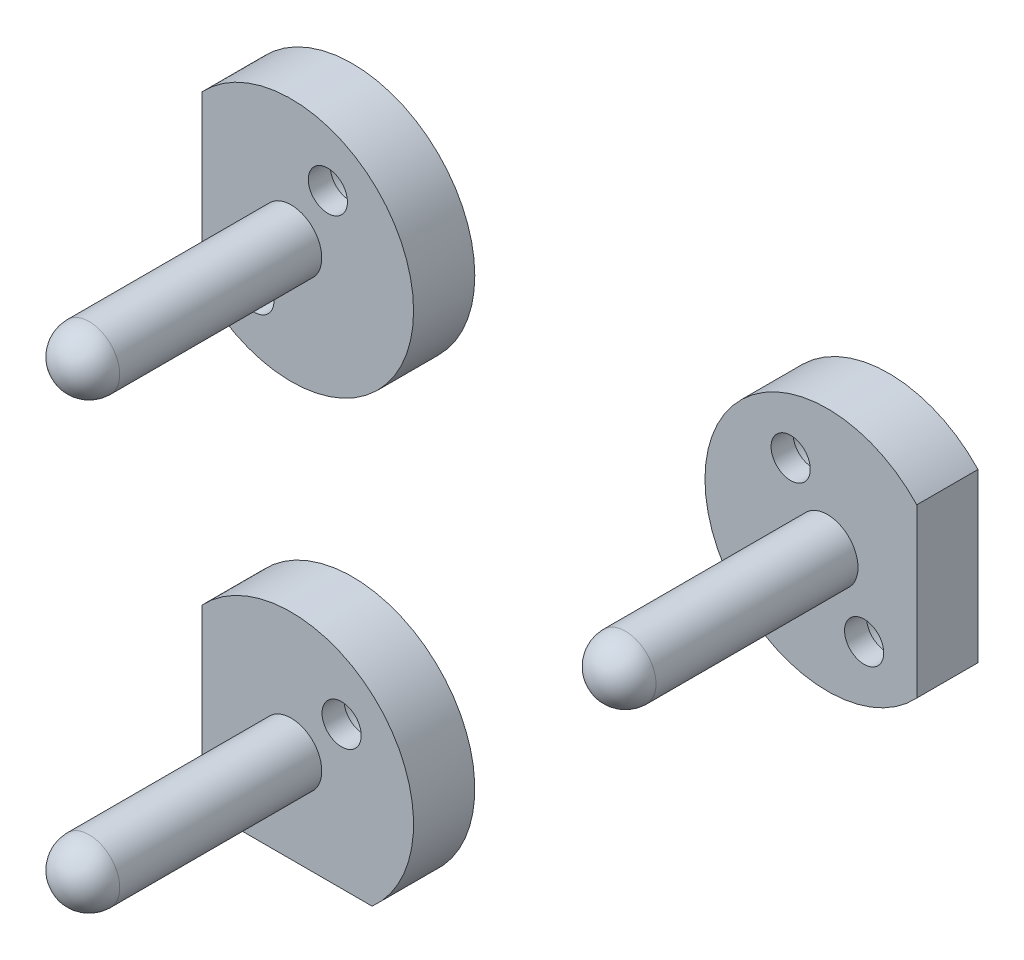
ISO-10303-21;
HEADER;
FILE_DESCRIPTION(('STEP AP214'),'2;1');
FILE_NAME('part.step','',(''),(''),'','','');
FILE_SCHEMA(('AUTOMOTIVE_DESIGN { 1 0 10303 214 1 1 1 1 }'));
ENDSEC;
DATA;
#1=APPLICATION_CONTEXT('core data for automotive mechanical design processes');
#2=APPLICATION_PROTOCOL_DEFINITION('international standard','automotive_design',2000,#1);
#3=PRODUCT_CONTEXT('',#1,'mechanical');
#4=PRODUCT('Part','Part','',(#3));
#5=PRODUCT_RELATED_PRODUCT_CATEGORY('part','',(#4));
#6=PRODUCT_DEFINITION_FORMATION('','',#4);
#7=PRODUCT_DEFINITION_CONTEXT('part definition',#1,'design');
#8=PRODUCT_DEFINITION('design','',#6,#7);
#9=PRODUCT_DEFINITION_SHAPE('','',#8);
#10=(LENGTH_UNIT() NAMED_UNIT(*) SI_UNIT(.MILLI.,.METRE.));
#11=(NAMED_UNIT(*) PLANE_ANGLE_UNIT() SI_UNIT($,.RADIAN.));
#12=(NAMED_UNIT(*) SI_UNIT($,.STERADIAN.) SOLID_ANGLE_UNIT());
#13=UNCERTAINTY_MEASURE_WITH_UNIT(LENGTH_MEASURE(1.E-05),#10,'distance_accuracy_value','');
#14=(GEOMETRIC_REPRESENTATION_CONTEXT(3) GLOBAL_UNCERTAINTY_ASSIGNED_CONTEXT((#13)) GLOBAL_UNIT_ASSIGNED_CONTEXT((#10,
#11,#12)) REPRESENTATION_CONTEXT('',''));
#15=CARTESIAN_POINT('',(0.,0.,0.));
#16=DIRECTION('',(0.,0.,1.));
#17=DIRECTION('',(1.,0.,0.));
#18=AXIS2_PLACEMENT_3D('',#15,#16,#17);
#19=CARTESIAN_POINT('',(21.9,16.9,5.));
#20=DIRECTION('',(0.,0.,-1.));
#21=DIRECTION('',(-1.,0.,0.));
#22=AXIS2_PLACEMENT_3D('',#19,#20,#21);
#23=CYLINDRICAL_SURFACE('',#22,10.);
#24=DIRECTION('',(0.,0.,-1.));
#25=VECTOR('',#24,1.);
#26=CARTESIAN_POINT('',(29.2,10.0655285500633,10.));
#27=LINE('',#26,#25);
#28=CARTESIAN_POINT('',(29.2,10.0655285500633,5.));
#29=VERTEX_POINT('',#28);
#30=CARTESIAN_POINT('',(29.2,10.0655285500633,0.));
#31=VERTEX_POINT('',#30);
#32=EDGE_CURVE('E63',#29,#31,#27,.T.);
#33=ORIENTED_EDGE('',*,*,#32,.F.);
#34=CARTESIAN_POINT('',(21.9,16.9,5.));
#35=DIRECTION('',(0.,0.,1.));
#36=DIRECTION('',(-1.,0.,0.));
#37=AXIS2_PLACEMENT_3D('',#34,#35,#36);
#38=CIRCLE('',#37,10.);
#39=CARTESIAN_POINT('',(29.2,23.7344714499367,5.));
#40=VERTEX_POINT('',#39);
#41=EDGE_CURVE('E84',#40,#29,#38,.T.);
#42=ORIENTED_EDGE('',*,*,#41,.F.);
#43=DIRECTION('',(0.,0.,-1.));
#44=VECTOR('',#43,1.);
#45=CARTESIAN_POINT('',(29.2,23.7344714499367,10.));
#46=LINE('',#45,#44);
#47=CARTESIAN_POINT('',(29.2,23.7344714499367,0.));
#48=VERTEX_POINT('',#47);
#49=EDGE_CURVE('E68',#40,#48,#46,.T.);
#50=ORIENTED_EDGE('',*,*,#49,.T.);
#51=CARTESIAN_POINT('',(21.9,16.9,0.));
#52=DIRECTION('',(0.,0.,1.));
#53=DIRECTION('',(-1.,0.,0.));
#54=AXIS2_PLACEMENT_3D('',#51,#52,#53);
#55=CIRCLE('',#54,10.);
#56=EDGE_CURVE('E82',#48,#31,#55,.T.);
#57=ORIENTED_EDGE('',*,*,#56,.T.);
#58=EDGE_LOOP('',(#33,#42,#50,#57));
#59=FACE_BOUND('',#58,.T.);
#60=ADVANCED_FACE('F48',(#59),#23,.T.);
#61=CARTESIAN_POINT('',(21.9,16.9,5.));
#62=DIRECTION('',(0.,0.,-1.));
#63=DIRECTION('',(-1.,0.,0.));
#64=AXIS2_PLACEMENT_3D('',#61,#62,#63);
#65=PLANE('',#64);
#66=CARTESIAN_POINT('',(18.9,21.9,5.));
#67=DIRECTION('',(0.,0.,-1.));
#68=DIRECTION('',(-1.,0.,0.));
#69=AXIS2_PLACEMENT_3D('',#66,#67,#68);
#70=CIRCLE('',#69,1.6);
#71=CARTESIAN_POINT('',(17.3,21.9,5.));
#72=VERTEX_POINT('',#71);
#73=EDGE_CURVE('E98',#72,#72,#70,.F.);
#74=ORIENTED_EDGE('',*,*,#73,.F.);
#75=EDGE_LOOP('',(#74));
#76=FACE_BOUND('',#75,.T.);
#77=CARTESIAN_POINT('',(24.9,11.9,5.));
#78=DIRECTION('',(0.,0.,-1.));
#79=DIRECTION('',(-1.,0.,0.));
#80=AXIS2_PLACEMENT_3D('',#77,#78,#79);
#81=CIRCLE('',#80,1.6);
#82=CARTESIAN_POINT('',(23.3,11.9,5.));
#83=VERTEX_POINT('',#82);
#84=EDGE_CURVE('E110',#83,#83,#81,.F.);
#85=ORIENTED_EDGE('',*,*,#84,.F.);
#86=EDGE_LOOP('',(#85));
#87=FACE_BOUND('',#86,.T.);
#88=CARTESIAN_POINT('',(21.9,16.9,5.));
#89=DIRECTION('',(0.,0.,1.));
#90=DIRECTION('',(1.,0.,0.));
#91=AXIS2_PLACEMENT_3D('',#88,#89,#90);
#92=CIRCLE('',#91,2.5);
#93=CARTESIAN_POINT('',(24.4,16.9,5.));
#94=VERTEX_POINT('',#93);
#95=EDGE_CURVE('E56',#94,#94,#92,.T.);
#96=ORIENTED_EDGE('',*,*,#95,.F.);
#97=EDGE_LOOP('',(#96));
#98=FACE_BOUND('',#97,.T.);
#99=DIRECTION('',(0.,-1.,0.));
#100=VECTOR('',#99,1.);
#101=CARTESIAN_POINT('',(29.2,16.9,5.));
#102=LINE('',#101,#100);
#103=EDGE_CURVE('E78',#40,#29,#102,.T.);
#104=ORIENTED_EDGE('',*,*,#103,.F.);
#105=ORIENTED_EDGE('',*,*,#41,.T.);
#106=EDGE_LOOP('',(#104,#105));
#107=FACE_BOUND('',#106,.T.);
#108=ADVANCED_FACE('F138',(#76,#87,#98,#107),#65,.F.);
#109=CARTESIAN_POINT('',(21.9,16.9,0.));
#110=DIRECTION('',(0.,0.,-1.));
#111=DIRECTION('',(-1.,0.,0.));
#112=AXIS2_PLACEMENT_3D('',#109,#110,#111);
#113=PLANE('',#112);
#114=CARTESIAN_POINT('',(18.9,21.9,0.));
#115=DIRECTION('',(0.,0.,-1.));
#116=DIRECTION('',(-1.,0.,0.));
#117=AXIS2_PLACEMENT_3D('',#114,#115,#116);
#118=CIRCLE('',#117,2.85);
#119=CARTESIAN_POINT('',(16.05,21.9,0.));
#120=VERTEX_POINT('',#119);
#121=EDGE_CURVE('E101',#120,#120,#118,.T.);
#122=ORIENTED_EDGE('',*,*,#121,.F.);
#123=EDGE_LOOP('',(#122));
#124=FACE_BOUND('',#123,.T.);
#125=CARTESIAN_POINT('',(24.9,11.9,0.));
#126=DIRECTION('',(0.,0.,-1.));
#127=DIRECTION('',(-1.,0.,0.));
#128=AXIS2_PLACEMENT_3D('',#125,#126,#127);
#129=CIRCLE('',#128,2.85);
#130=CARTESIAN_POINT('',(22.05,11.9,0.));
#131=VERTEX_POINT('',#130);
#132=EDGE_CURVE('E97',#131,#131,#129,.T.);
#133=ORIENTED_EDGE('',*,*,#132,.F.);
#134=EDGE_LOOP('',(#133));
#135=FACE_BOUND('',#134,.T.);
#136=ORIENTED_EDGE('',*,*,#56,.F.);
#137=DIRECTION('',(0.,-1.,0.));
#138=VECTOR('',#137,1.);
#139=CARTESIAN_POINT('',(29.2,23.7344714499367,0.));
#140=LINE('',#139,#138);
#141=EDGE_CURVE('E73',#48,#31,#140,.T.);
#142=ORIENTED_EDGE('',*,*,#141,.T.);
#143=EDGE_LOOP('',(#136,#142));
#144=FACE_BOUND('',#143,.T.);
#145=ADVANCED_FACE('F87',(#124,#135,#144),#113,.T.);
#146=CARTESIAN_POINT('',(21.9,16.9,24.));
#147=DIRECTION('',(0.,0.,-1.));
#148=DIRECTION('',(-1.,0.,0.));
#149=AXIS2_PLACEMENT_3D('',#146,#147,#148);
#150=CYLINDRICAL_SURFACE('',#149,2.5);
#151=CARTESIAN_POINT('',(21.9,16.9,21.5));
#152=DIRECTION('',(0.,0.,-1.));
#153=DIRECTION('',(-1.,0.,0.));
#154=AXIS2_PLACEMENT_3D('',#151,#152,#153);
#155=CIRCLE('',#154,2.5);
#156=CARTESIAN_POINT('',(19.4,16.9,21.5));
#157=VERTEX_POINT('',#156);
#158=EDGE_CURVE('E12',#157,#157,#155,.T.);
#159=ORIENTED_EDGE('',*,*,#158,.T.);
#160=EDGE_LOOP('',(#159));
#161=FACE_BOUND('',#160,.T.);
#162=ORIENTED_EDGE('',*,*,#95,.T.);
#163=EDGE_LOOP('',(#162));
#164=FACE_BOUND('',#163,.T.);
#165=ADVANCED_FACE('F137',(#161,#164),#150,.T.);
#166=CARTESIAN_POINT('',(21.9,16.9,21.5));
#167=DIRECTION('',(0.,0.,1.));
#168=DIRECTION('',(1.,0.,0.));
#169=AXIS2_PLACEMENT_3D('',#166,#167,#168);
#170=SPHERICAL_SURFACE('',#169,2.5);
#171=ORIENTED_EDGE('',*,*,#158,.F.);
#172=EDGE_LOOP('',(#171));
#173=FACE_BOUND('',#172,.T.);
#174=ADVANCED_FACE('F50',(#173),#170,.T.);
#175=CARTESIAN_POINT('',(29.2,23.7344714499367,10.));
#176=DIRECTION('',(1.,0.,0.));
#177=DIRECTION('',(0.,1.,0.));
#178=AXIS2_PLACEMENT_3D('',#175,#176,#177);
#179=PLANE('',#178);
#180=ORIENTED_EDGE('',*,*,#103,.T.);
#181=ORIENTED_EDGE('',*,*,#32,.T.);
#182=ORIENTED_EDGE('',*,*,#141,.F.);
#183=ORIENTED_EDGE('',*,*,#49,.F.);
#184=EDGE_LOOP('',(#180,#181,#182,#183));
#185=FACE_BOUND('',#184,.T.);
#186=ADVANCED_FACE('F74',(#185),#179,.T.);
#187=CARTESIAN_POINT('',(24.9,11.9,3.2));
#188=DIRECTION('',(0.,0.,-1.));
#189=DIRECTION('',(-1.,0.,0.));
#190=AXIS2_PLACEMENT_3D('',#187,#188,#189);
#191=CYLINDRICAL_SURFACE('',#190,2.85);
#192=CARTESIAN_POINT('',(24.9,11.9,3.2));
#193=DIRECTION('',(0.,0.,-1.));
#194=DIRECTION('',(-1.,0.,0.));
#195=AXIS2_PLACEMENT_3D('',#192,#193,#194);
#196=CIRCLE('',#195,2.85);
#197=CARTESIAN_POINT('',(22.05,11.9,3.2));
#198=VERTEX_POINT('',#197);
#199=EDGE_CURVE('E94',#198,#198,#196,.T.);
#200=ORIENTED_EDGE('',*,*,#199,.F.);
#201=EDGE_LOOP('',(#200));
#202=FACE_BOUND('',#201,.T.);
#203=ORIENTED_EDGE('',*,*,#132,.T.);
#204=EDGE_LOOP('',(#203));
#205=FACE_BOUND('',#204,.T.);
#206=ADVANCED_FACE('F142',(#202,#205),#191,.F.);
#207=CARTESIAN_POINT('',(24.9,11.9,3.2));
#208=DIRECTION('',(0.,0.,-1.));
#209=DIRECTION('',(-1.,0.,0.));
#210=AXIS2_PLACEMENT_3D('',#207,#208,#209);
#211=PLANE('',#210);
#212=CARTESIAN_POINT('',(24.9,11.9,3.2));
#213=DIRECTION('',(0.,0.,-1.));
#214=DIRECTION('',(-1.,0.,0.));
#215=AXIS2_PLACEMENT_3D('',#212,#213,#214);
#216=CIRCLE('',#215,1.6);
#217=CARTESIAN_POINT('',(23.3,11.9,3.2));
#218=VERTEX_POINT('',#217);
#219=EDGE_CURVE('E106',#218,#218,#216,.T.);
#220=ORIENTED_EDGE('',*,*,#219,.F.);
#221=EDGE_LOOP('',(#220));
#222=FACE_BOUND('',#221,.T.);
#223=ORIENTED_EDGE('',*,*,#199,.T.);
#224=EDGE_LOOP('',(#223));
#225=FACE_BOUND('',#224,.T.);
#226=ADVANCED_FACE('F131',(#222,#225),#211,.T.);
#227=CARTESIAN_POINT('',(18.9,21.9,3.2));
#228=DIRECTION('',(0.,0.,-1.));
#229=DIRECTION('',(-1.,0.,0.));
#230=AXIS2_PLACEMENT_3D('',#227,#228,#229);
#231=CYLINDRICAL_SURFACE('',#230,2.85);
#232=CARTESIAN_POINT('',(18.9,21.9,3.2));
#233=DIRECTION('',(0.,0.,-1.));
#234=DIRECTION('',(-1.,0.,0.));
#235=AXIS2_PLACEMENT_3D('',#232,#233,#234);
#236=CIRCLE('',#235,2.85);
#237=CARTESIAN_POINT('',(16.05,21.9,3.2));
#238=VERTEX_POINT('',#237);
#239=EDGE_CURVE('E85',#238,#238,#236,.T.);
#240=ORIENTED_EDGE('',*,*,#239,.F.);
#241=EDGE_LOOP('',(#240));
#242=FACE_BOUND('',#241,.T.);
#243=ORIENTED_EDGE('',*,*,#121,.T.);
#244=EDGE_LOOP('',(#243));
#245=FACE_BOUND('',#244,.T.);
#246=ADVANCED_FACE('F125',(#242,#245),#231,.F.);
#247=CARTESIAN_POINT('',(18.9,21.9,3.2));
#248=DIRECTION('',(0.,0.,-1.));
#249=DIRECTION('',(-1.,0.,0.));
#250=AXIS2_PLACEMENT_3D('',#247,#248,#249);
#251=PLANE('',#250);
#252=CARTESIAN_POINT('',(18.9,21.9,3.2));
#253=DIRECTION('',(0.,0.,-1.));
#254=DIRECTION('',(-1.,0.,0.));
#255=AXIS2_PLACEMENT_3D('',#252,#253,#254);
#256=CIRCLE('',#255,1.6);
#257=CARTESIAN_POINT('',(17.3,21.9,3.2));
#258=VERTEX_POINT('',#257);
#259=EDGE_CURVE('E109',#258,#258,#256,.T.);
#260=ORIENTED_EDGE('',*,*,#259,.F.);
#261=EDGE_LOOP('',(#260));
#262=FACE_BOUND('',#261,.T.);
#263=ORIENTED_EDGE('',*,*,#239,.T.);
#264=EDGE_LOOP('',(#263));
#265=FACE_BOUND('',#264,.T.);
#266=ADVANCED_FACE('F121',(#262,#265),#251,.T.);
#267=CARTESIAN_POINT('',(24.9,11.9,24.001));
#268=DIRECTION('',(0.,0.,-1.));
#269=DIRECTION('',(-1.,0.,0.));
#270=AXIS2_PLACEMENT_3D('',#267,#268,#269);
#271=CYLINDRICAL_SURFACE('',#270,1.6);
#272=CARTESIAN_POINT('',(23.3,11.9,3.2));
#273=CARTESIAN_POINT('',(23.3,11.9,3.21875));
#274=CARTESIAN_POINT('',(23.3,11.9,3.2375));
#275=CARTESIAN_POINT('',(23.3,11.9,3.275));
#276=CARTESIAN_POINT('',(23.3,11.9,3.29375));
#277=CARTESIAN_POINT('',(23.3,11.9,3.33125));
#278=CARTESIAN_POINT('',(23.3,11.9,3.35));
#279=CARTESIAN_POINT('',(23.3,11.9,3.3875));
#280=CARTESIAN_POINT('',(23.3,11.9,3.40625));
#281=CARTESIAN_POINT('',(23.3,11.9,3.44375));
#282=CARTESIAN_POINT('',(23.3,11.9,3.4625));
#283=CARTESIAN_POINT('',(23.3,11.9,3.5));
#284=CARTESIAN_POINT('',(23.3,11.9,3.51875));
#285=CARTESIAN_POINT('',(23.3,11.9,3.55625));
#286=CARTESIAN_POINT('',(23.3,11.9,3.575));
#287=CARTESIAN_POINT('',(23.3,11.9,3.6125));
#288=CARTESIAN_POINT('',(23.3,11.9,3.63125));
#289=CARTESIAN_POINT('',(23.3,11.9,3.66875));
#290=CARTESIAN_POINT('',(23.3,11.9,3.6875));
#291=CARTESIAN_POINT('',(23.3,11.9,3.725));
#292=CARTESIAN_POINT('',(23.3,11.9,3.74375));
#293=CARTESIAN_POINT('',(23.3,11.9,3.78125));
#294=CARTESIAN_POINT('',(23.3,11.9,3.8));
#295=CARTESIAN_POINT('',(23.3,11.9,3.8375));
#296=CARTESIAN_POINT('',(23.3,11.9,3.85625));
#297=CARTESIAN_POINT('',(23.3,11.9,3.89375));
#298=CARTESIAN_POINT('',(23.3,11.9,3.9125));
#299=CARTESIAN_POINT('',(23.3,11.9,3.95));
#300=CARTESIAN_POINT('',(23.3,11.9,3.96875));
#301=CARTESIAN_POINT('',(23.3,11.9,4.00625));
#302=CARTESIAN_POINT('',(23.3,11.9,4.025));
#303=CARTESIAN_POINT('',(23.3,11.9,4.0625));
#304=CARTESIAN_POINT('',(23.3,11.9,4.08125));
#305=CARTESIAN_POINT('',(23.3,11.9,4.11875));
#306=CARTESIAN_POINT('',(23.3,11.9,4.1375));
#307=CARTESIAN_POINT('',(23.3,11.9,4.175));
#308=CARTESIAN_POINT('',(23.3,11.9,4.19375));
#309=CARTESIAN_POINT('',(23.3,11.9,4.23125));
#310=CARTESIAN_POINT('',(23.3,11.9,4.25));
#311=CARTESIAN_POINT('',(23.3,11.9,4.2875));
#312=CARTESIAN_POINT('',(23.3,11.9,4.30625));
#313=CARTESIAN_POINT('',(23.3,11.9,4.34375));
#314=CARTESIAN_POINT('',(23.3,11.9,4.3625));
#315=CARTESIAN_POINT('',(23.3,11.9,4.4));
#316=CARTESIAN_POINT('',(23.3,11.9,4.41875));
#317=CARTESIAN_POINT('',(23.3,11.9,4.45625));
#318=CARTESIAN_POINT('',(23.3,11.9,4.475));
#319=CARTESIAN_POINT('',(23.3,11.9,4.5125));
#320=CARTESIAN_POINT('',(23.3,11.9,4.53125));
#321=CARTESIAN_POINT('',(23.3,11.9,4.56875));
#322=CARTESIAN_POINT('',(23.3,11.9,4.5875));
#323=CARTESIAN_POINT('',(23.3,11.9,4.625));
#324=CARTESIAN_POINT('',(23.3,11.9,4.64375));
#325=CARTESIAN_POINT('',(23.3,11.9,4.68125));
#326=CARTESIAN_POINT('',(23.3,11.9,4.7));
#327=CARTESIAN_POINT('',(23.3,11.9,4.7375));
#328=CARTESIAN_POINT('',(23.3,11.9,4.75625));
#329=CARTESIAN_POINT('',(23.3,11.9,4.79375));
#330=CARTESIAN_POINT('',(23.3,11.9,4.8125));
#331=CARTESIAN_POINT('',(23.3,11.9,4.85));
#332=CARTESIAN_POINT('',(23.3,11.9,4.86875));
#333=CARTESIAN_POINT('',(23.3,11.9,4.90625));
#334=CARTESIAN_POINT('',(23.3,11.9,4.925));
#335=CARTESIAN_POINT('',(23.3,11.9,4.9625));
#336=CARTESIAN_POINT('',(23.3,11.9,4.98125));
#337=CARTESIAN_POINT('',(23.3,11.9,5.));
#338=B_SPLINE_CURVE_WITH_KNOTS('',3,(#272,#273,#274,#275,#276,#277,#278,#279,#280,#281,#282,
#283,#284,#285,#286,#287,#288,#289,#290,#291,#292,#293,#294,#295,#296,#297,#298,#299,#300,#301,
#302,#303,#304,#305,#306,#307,#308,#309,#310,#311,#312,#313,#314,#315,#316,#317,#318,#319,#320,
#321,#322,#323,#324,#325,#326,#327,#328,#329,#330,#331,#332,#333,#334,#335,#336,#337),
.UNSPECIFIED.,.F.,.F.,(4,2,2,2,2,2,2,2,2,2,2,2,2,2,2,2,2,2,2,2,2,2,2,2,2,2,2,2,2,2,2,2,4),(0.,
0.0562500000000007,0.112500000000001,0.168749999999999,0.225,0.28125,0.337500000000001,
0.393750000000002,0.449999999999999,0.50625,0.5625,0.618750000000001,0.675000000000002,
0.731250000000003,0.7875,0.843750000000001,0.900000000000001,0.956250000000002,1.0125,1.06875,
1.125,1.18125,1.2375,1.29375,1.35,1.40625,1.4625,1.51875,1.575,1.63125,1.6875,1.74375,1.8),.UNSPECIFIED.);
#339=EDGE_CURVE('BSEAM124',#218,#83,#338,.T.);
#340=ORIENTED_EDGE('',*,*,#219,.T.);
#341=ORIENTED_EDGE('',*,*,#84,.T.);
#342=ORIENTED_EDGE('',*,*,#339,.T.);
#343=ORIENTED_EDGE('',*,*,#339,.F.);
#344=EDGE_LOOP('',(#340,#342,#341,#343));
#345=FACE_BOUND('',#344,.T.);
#346=ADVANCED_FACE('F124',(#345),#271,.F.);
#347=CARTESIAN_POINT('',(18.9,21.9,24.001));
#348=DIRECTION('',(0.,0.,-1.));
#349=DIRECTION('',(-1.,0.,0.));
#350=AXIS2_PLACEMENT_3D('',#347,#348,#349);
#351=CYLINDRICAL_SURFACE('',#350,1.6);
#352=CARTESIAN_POINT('',(17.3,21.9,3.2));
#353=CARTESIAN_POINT('',(17.3,21.9,3.21875));
#354=CARTESIAN_POINT('',(17.3,21.9,3.2375));
#355=CARTESIAN_POINT('',(17.3,21.9,3.275));
#356=CARTESIAN_POINT('',(17.3,21.9,3.29375));
#357=CARTESIAN_POINT('',(17.3,21.9,3.33125));
#358=CARTESIAN_POINT('',(17.3,21.9,3.35));
#359=CARTESIAN_POINT('',(17.3,21.9,3.3875));
#360=CARTESIAN_POINT('',(17.3,21.9,3.40625));
#361=CARTESIAN_POINT('',(17.3,21.9,3.44375));
#362=CARTESIAN_POINT('',(17.3,21.9,3.4625));
#363=CARTESIAN_POINT('',(17.3,21.9,3.5));
#364=CARTESIAN_POINT('',(17.3,21.9,3.51875));
#365=CARTESIAN_POINT('',(17.3,21.9,3.55625));
#366=CARTESIAN_POINT('',(17.3,21.9,3.575));
#367=CARTESIAN_POINT('',(17.3,21.9,3.6125));
#368=CARTESIAN_POINT('',(17.3,21.9,3.63125));
#369=CARTESIAN_POINT('',(17.3,21.9,3.66875));
#370=CARTESIAN_POINT('',(17.3,21.9,3.6875));
#371=CARTESIAN_POINT('',(17.3,21.9,3.725));
#372=CARTESIAN_POINT('',(17.3,21.9,3.74375));
#373=CARTESIAN_POINT('',(17.3,21.9,3.78125));
#374=CARTESIAN_POINT('',(17.3,21.9,3.8));
#375=CARTESIAN_POINT('',(17.3,21.9,3.8375));
#376=CARTESIAN_POINT('',(17.3,21.9,3.85625));
#377=CARTESIAN_POINT('',(17.3,21.9,3.89375));
#378=CARTESIAN_POINT('',(17.3,21.9,3.9125));
#379=CARTESIAN_POINT('',(17.3,21.9,3.95));
#380=CARTESIAN_POINT('',(17.3,21.9,3.96875));
#381=CARTESIAN_POINT('',(17.3,21.9,4.00625));
#382=CARTESIAN_POINT('',(17.3,21.9,4.025));
#383=CARTESIAN_POINT('',(17.3,21.9,4.0625));
#384=CARTESIAN_POINT('',(17.3,21.9,4.08125));
#385=CARTESIAN_POINT('',(17.3,21.9,4.11875));
#386=CARTESIAN_POINT('',(17.3,21.9,4.1375));
#387=CARTESIAN_POINT('',(17.3,21.9,4.175));
#388=CARTESIAN_POINT('',(17.3,21.9,4.19375));
#389=CARTESIAN_POINT('',(17.3,21.9,4.23125));
#390=CARTESIAN_POINT('',(17.3,21.9,4.25));
#391=CARTESIAN_POINT('',(17.3,21.9,4.2875));
#392=CARTESIAN_POINT('',(17.3,21.9,4.30625));
#393=CARTESIAN_POINT('',(17.3,21.9,4.34375));
#394=CARTESIAN_POINT('',(17.3,21.9,4.3625));
#395=CARTESIAN_POINT('',(17.3,21.9,4.4));
#396=CARTESIAN_POINT('',(17.3,21.9,4.41875));
#397=CARTESIAN_POINT('',(17.3,21.9,4.45625));
#398=CARTESIAN_POINT('',(17.3,21.9,4.475));
#399=CARTESIAN_POINT('',(17.3,21.9,4.5125));
#400=CARTESIAN_POINT('',(17.3,21.9,4.53125));
#401=CARTESIAN_POINT('',(17.3,21.9,4.56875));
#402=CARTESIAN_POINT('',(17.3,21.9,4.5875));
#403=CARTESIAN_POINT('',(17.3,21.9,4.625));
#404=CARTESIAN_POINT('',(17.3,21.9,4.64375));
#405=CARTESIAN_POINT('',(17.3,21.9,4.68125));
#406=CARTESIAN_POINT('',(17.3,21.9,4.7));
#407=CARTESIAN_POINT('',(17.3,21.9,4.7375));
#408=CARTESIAN_POINT('',(17.3,21.9,4.75625));
#409=CARTESIAN_POINT('',(17.3,21.9,4.79375));
#410=CARTESIAN_POINT('',(17.3,21.9,4.8125));
#411=CARTESIAN_POINT('',(17.3,21.9,4.85));
#412=CARTESIAN_POINT('',(17.3,21.9,4.86875));
#413=CARTESIAN_POINT('',(17.3,21.9,4.90625));
#414=CARTESIAN_POINT('',(17.3,21.9,4.925));
#415=CARTESIAN_POINT('',(17.3,21.9,4.9625));
#416=CARTESIAN_POINT('',(17.3,21.9,4.98125));
#417=CARTESIAN_POINT('',(17.3,21.9,5.));
#418=B_SPLINE_CURVE_WITH_KNOTS('',3,(#352,#353,#354,#355,#356,#357,#358,#359,#360,#361,#362,
#363,#364,#365,#366,#367,#368,#369,#370,#371,#372,#373,#374,#375,#376,#377,#378,#379,#380,#381,
#382,#383,#384,#385,#386,#387,#388,#389,#390,#391,#392,#393,#394,#395,#396,#397,#398,#399,#400,
#401,#402,#403,#404,#405,#406,#407,#408,#409,#410,#411,#412,#413,#414,#415,#416,#417),
.UNSPECIFIED.,.F.,.F.,(4,2,2,2,2,2,2,2,2,2,2,2,2,2,2,2,2,2,2,2,2,2,2,2,2,2,2,2,2,2,2,2,4),(0.,
0.0562500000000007,0.112500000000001,0.168749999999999,0.225,0.28125,0.337500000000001,
0.393750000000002,0.449999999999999,0.50625,0.5625,0.618750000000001,0.675000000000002,
0.731250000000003,0.7875,0.843750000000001,0.900000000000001,0.956250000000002,1.0125,1.06875,
1.125,1.18125,1.2375,1.29375,1.35,1.40625,1.4625,1.51875,1.575,1.63125,1.6875,1.74375,1.8),.UNSPECIFIED.);
#419=EDGE_CURVE('BSEAM118',#258,#72,#418,.T.);
#420=ORIENTED_EDGE('',*,*,#259,.T.);
#421=ORIENTED_EDGE('',*,*,#73,.T.);
#422=ORIENTED_EDGE('',*,*,#419,.T.);
#423=ORIENTED_EDGE('',*,*,#419,.F.);
#424=EDGE_LOOP('',(#420,#422,#421,#423));
#425=FACE_BOUND('',#424,.T.);
#426=ADVANCED_FACE('F118',(#425),#351,.F.);
#427=CLOSED_SHELL('',(#60,#108,#145,#165,#174,#186,#206,#226,#246,#266,#346,#426));
#428=MANIFOLD_SOLID_BREP('B2',#427);
#429=CARTESIAN_POINT('',(-21.9,-19.4,5.));
#430=DIRECTION('',(0.,0.,-1.));
#431=DIRECTION('',(-1.,0.,0.));
#432=AXIS2_PLACEMENT_3D('',#429,#430,#431);
#433=CYLINDRICAL_SURFACE('',#432,10.);
#434=DIRECTION('',(0.,0.,-1.));
#435=VECTOR('',#434,1.);
#436=CARTESIAN_POINT('',(-28.5143782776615,-26.9,10.));
#437=LINE('',#436,#435);
#438=CARTESIAN_POINT('',(-28.5143782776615,-26.9,5.));
#439=VERTEX_POINT('',#438);
#440=CARTESIAN_POINT('',(-28.5143782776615,-26.9,0.));
#441=VERTEX_POINT('',#440);
#442=EDGE_CURVE('E300',#439,#441,#437,.T.);
#443=ORIENTED_EDGE('',*,*,#442,.F.);
#444=CARTESIAN_POINT('',(-21.9,-19.4,5.));
#445=DIRECTION('',(0.,0.,1.));
#446=DIRECTION('',(1.,0.,0.));
#447=AXIS2_PLACEMENT_3D('',#444,#445,#446);
#448=CIRCLE('',#447,10.);
#449=CARTESIAN_POINT('',(-29.2,-26.2344714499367,5.));
#450=VERTEX_POINT('',#449);
#451=EDGE_CURVE('E344',#450,#439,#448,.T.);
#452=ORIENTED_EDGE('',*,*,#451,.F.);
#453=DIRECTION('',(0.,0.,-1.));
#454=VECTOR('',#453,1.);
#455=CARTESIAN_POINT('',(-29.2,-26.2344714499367,10.));
#456=LINE('',#455,#454);
#457=CARTESIAN_POINT('',(-29.2,-26.2344714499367,0.));
#458=VERTEX_POINT('',#457);
#459=EDGE_CURVE('E357',#450,#458,#456,.T.);
#460=ORIENTED_EDGE('',*,*,#459,.T.);
#461=CARTESIAN_POINT('',(-21.9,-19.4,0.));
#462=DIRECTION('',(0.,0.,1.));
#463=DIRECTION('',(1.,0.,0.));
#464=AXIS2_PLACEMENT_3D('',#461,#462,#463);
#465=CIRCLE('',#464,10.);
#466=EDGE_CURVE('E343',#458,#441,#465,.T.);
#467=ORIENTED_EDGE('',*,*,#466,.T.);
#468=EDGE_LOOP('',(#443,#452,#460,#467));
#469=FACE_BOUND('',#468,.T.);
#470=ADVANCED_FACE('F285',(#469),#433,.T.);
#471=DIRECTION('',(0.,0.,-1.));
#472=VECTOR('',#471,1.);
#473=CARTESIAN_POINT('',(-15.2856217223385,-26.9,10.));
#474=LINE('',#473,#472);
#475=CARTESIAN_POINT('',(-15.2856217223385,-26.9,5.));
#476=VERTEX_POINT('',#475);
#477=CARTESIAN_POINT('',(-15.2856217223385,-26.9,0.));
#478=VERTEX_POINT('',#477);
#479=EDGE_CURVE('E326',#476,#478,#474,.T.);
#480=ORIENTED_EDGE('',*,*,#479,.T.);
#481=CARTESIAN_POINT('',(-29.2,-12.5655285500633,0.));
#482=VERTEX_POINT('',#481);
#483=EDGE_CURVE('E338',#478,#482,#465,.T.);
#484=ORIENTED_EDGE('',*,*,#483,.T.);
#485=DIRECTION('',(0.,0.,-1.));
#486=VECTOR('',#485,1.);
#487=CARTESIAN_POINT('',(-29.2,-12.5655285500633,10.));
#488=LINE('',#487,#486);
#489=CARTESIAN_POINT('',(-29.2,-12.5655285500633,5.));
#490=VERTEX_POINT('',#489);
#491=EDGE_CURVE('E308',#490,#482,#488,.T.);
#492=ORIENTED_EDGE('',*,*,#491,.F.);
#493=EDGE_CURVE('E340',#476,#490,#448,.T.);
#494=ORIENTED_EDGE('',*,*,#493,.F.);
#495=EDGE_LOOP('',(#480,#484,#492,#494));
#496=FACE_BOUND('',#495,.T.);
#497=ADVANCED_FACE('F337',(#496),#433,.T.);
#498=CARTESIAN_POINT('',(-21.9,-19.4,5.));
#499=DIRECTION('',(0.,0.,1.));
#500=DIRECTION('',(1.,0.,0.));
#501=AXIS2_PLACEMENT_3D('',#498,#499,#500);
#502=PLANE('',#501);
#503=CARTESIAN_POINT('',(-17.7768943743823,-15.2768943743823,5.));
#504=DIRECTION('',(0.,0.,1.));
#505=DIRECTION('',(1.,0.,0.));
#506=AXIS2_PLACEMENT_3D('',#503,#504,#505);
#507=CIRCLE('',#506,1.6);
#508=CARTESIAN_POINT('',(-19.3768943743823,-15.2768943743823,5.));
#509=VERTEX_POINT('',#508);
#510=EDGE_CURVE('E366',#509,#509,#507,.F.);
#511=ORIENTED_EDGE('',*,*,#510,.T.);
#512=EDGE_LOOP('',(#511));
#513=FACE_BOUND('',#512,.T.);
#514=CARTESIAN_POINT('',(-26.0231056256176,-23.5231056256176,5.));
#515=DIRECTION('',(0.,0.,1.));
#516=DIRECTION('',(1.,0.,0.));
#517=AXIS2_PLACEMENT_3D('',#514,#515,#516);
#518=CIRCLE('',#517,1.6);
#519=CARTESIAN_POINT('',(-27.6231056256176,-23.5231056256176,5.));
#520=VERTEX_POINT('',#519);
#521=EDGE_CURVE('E377',#520,#520,#518,.F.);
#522=ORIENTED_EDGE('',*,*,#521,.T.);
#523=EDGE_LOOP('',(#522));
#524=FACE_BOUND('',#523,.T.);
#525=CARTESIAN_POINT('',(-21.9,-19.4,5.));
#526=DIRECTION('',(0.,0.,1.));
#527=DIRECTION('',(1.,0.,0.));
#528=AXIS2_PLACEMENT_3D('',#525,#526,#527);
#529=CIRCLE('',#528,2.5);
#530=CARTESIAN_POINT('',(-19.4,-19.4,5.));
#531=VERTEX_POINT('',#530);
#532=EDGE_CURVE('E293',#531,#531,#529,.T.);
#533=ORIENTED_EDGE('',*,*,#532,.F.);
#534=EDGE_LOOP('',(#533));
#535=FACE_BOUND('',#534,.T.);
#536=ORIENTED_EDGE('',*,*,#451,.T.);
#537=DIRECTION('',(1.,0.,0.));
#538=VECTOR('',#537,1.);
#539=CARTESIAN_POINT('',(-21.9,-26.9,5.));
#540=LINE('',#539,#538);
#541=EDGE_CURVE('E349',#439,#476,#540,.T.);
#542=ORIENTED_EDGE('',*,*,#541,.T.);
#543=ORIENTED_EDGE('',*,*,#493,.T.);
#544=DIRECTION('',(0.,1.,0.));
#545=VECTOR('',#544,1.);
#546=CARTESIAN_POINT('',(-29.2,-19.4,5.));
#547=LINE('',#546,#545);
#548=EDGE_CURVE('E352',#450,#490,#547,.T.);
#549=ORIENTED_EDGE('',*,*,#548,.F.);
#550=EDGE_LOOP('',(#536,#542,#543,#549));
#551=FACE_BOUND('',#550,.T.);
#552=ADVANCED_FACE('F386',(#513,#524,#535,#551),#502,.T.);
#553=CARTESIAN_POINT('',(-21.9,-19.4,0.));
#554=DIRECTION('',(0.,0.,1.));
#555=DIRECTION('',(1.,0.,0.));
#556=AXIS2_PLACEMENT_3D('',#553,#554,#555);
#557=PLANE('',#556);
#558=CARTESIAN_POINT('',(-26.0231056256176,-23.5231056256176,0.));
#559=DIRECTION('',(0.,0.,-1.));
#560=DIRECTION('',(1.,0.,0.));
#561=AXIS2_PLACEMENT_3D('',#558,#559,#560);
#562=CIRCLE('',#561,2.85000000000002);
#563=CARTESIAN_POINT('',(-23.1731056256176,-23.5231056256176,0.));
#564=VERTEX_POINT('',#563);
#565=EDGE_CURVE('E359',#564,#564,#562,.T.);
#566=ORIENTED_EDGE('',*,*,#565,.F.);
#567=EDGE_LOOP('',(#566));
#568=FACE_BOUND('',#567,.T.);
#569=CARTESIAN_POINT('',(-17.7768943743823,-15.2768943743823,0.));
#570=DIRECTION('',(0.,0.,-1.));
#571=DIRECTION('',(1.,0.,0.));
#572=AXIS2_PLACEMENT_3D('',#569,#570,#571);
#573=CIRCLE('',#572,2.85000000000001);
#574=CARTESIAN_POINT('',(-14.9268943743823,-15.2768943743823,0.));
#575=VERTEX_POINT('',#574);
#576=EDGE_CURVE('E365',#575,#575,#573,.T.);
#577=ORIENTED_EDGE('',*,*,#576,.F.);
#578=EDGE_LOOP('',(#577));
#579=FACE_BOUND('',#578,.T.);
#580=DIRECTION('',(-1.,0.,0.));
#581=VECTOR('',#580,1.);
#582=CARTESIAN_POINT('',(0.,-26.9,0.));
#583=LINE('',#582,#581);
#584=EDGE_CURVE('E323',#478,#441,#583,.T.);
#585=ORIENTED_EDGE('',*,*,#584,.T.);
#586=ORIENTED_EDGE('',*,*,#466,.F.);
#587=DIRECTION('',(0.,-1.,0.));
#588=VECTOR('',#587,1.);
#589=CARTESIAN_POINT('',(-29.2,-12.5655285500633,0.));
#590=LINE('',#589,#588);
#591=EDGE_CURVE('E332',#482,#458,#590,.T.);
#592=ORIENTED_EDGE('',*,*,#591,.F.);
#593=ORIENTED_EDGE('',*,*,#483,.F.);
#594=EDGE_LOOP('',(#585,#586,#592,#593));
#595=FACE_BOUND('',#594,.T.);
#596=ADVANCED_FACE('F342',(#568,#579,#595),#557,.F.);
#597=CARTESIAN_POINT('',(-21.9,-19.4,24.));
#598=DIRECTION('',(0.,0.,-1.));
#599=DIRECTION('',(-1.,0.,0.));
#600=AXIS2_PLACEMENT_3D('',#597,#598,#599);
#601=CYLINDRICAL_SURFACE('',#600,2.5);
#602=CARTESIAN_POINT('',(-21.9,-19.4,21.5));
#603=DIRECTION('',(0.,0.,-1.));
#604=DIRECTION('',(-1.,0.,0.));
#605=AXIS2_PLACEMENT_3D('',#602,#603,#604);
#606=CIRCLE('',#605,2.5);
#607=CARTESIAN_POINT('',(-24.4,-19.4,21.5));
#608=VERTEX_POINT('',#607);
#609=EDGE_CURVE('E46',#608,#608,#606,.T.);
#610=ORIENTED_EDGE('',*,*,#609,.T.);
#611=EDGE_LOOP('',(#610));
#612=FACE_BOUND('',#611,.T.);
#613=ORIENTED_EDGE('',*,*,#532,.T.);
#614=EDGE_LOOP('',(#613));
#615=FACE_BOUND('',#614,.T.);
#616=ADVANCED_FACE('F410',(#612,#615),#601,.T.);
#617=CARTESIAN_POINT('',(-21.9,-19.4,21.5));
#618=DIRECTION('',(0.,0.,1.));
#619=DIRECTION('',(1.,0.,0.));
#620=AXIS2_PLACEMENT_3D('',#617,#618,#619);
#621=SPHERICAL_SURFACE('',#620,2.5);
#622=ORIENTED_EDGE('',*,*,#609,.F.);
#623=EDGE_LOOP('',(#622));
#624=FACE_BOUND('',#623,.T.);
#625=ADVANCED_FACE('F287',(#624),#621,.T.);
#626=CARTESIAN_POINT('',(-29.2,-12.5655285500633,10.));
#627=DIRECTION('',(1.,0.,0.));
#628=DIRECTION('',(0.,1.,0.));
#629=AXIS2_PLACEMENT_3D('',#626,#627,#628);
#630=PLANE('',#629);
#631=ORIENTED_EDGE('',*,*,#548,.T.);
#632=ORIENTED_EDGE('',*,*,#491,.T.);
#633=ORIENTED_EDGE('',*,*,#591,.T.);
#634=ORIENTED_EDGE('',*,*,#459,.F.);
#635=EDGE_LOOP('',(#631,#632,#633,#634));
#636=FACE_BOUND('',#635,.T.);
#637=ADVANCED_FACE('F427',(#636),#630,.F.);
#638=CARTESIAN_POINT('',(0.,-26.9,10.));
#639=DIRECTION('',(0.,-1.,0.));
#640=DIRECTION('',(1.,0.,0.));
#641=AXIS2_PLACEMENT_3D('',#638,#639,#640);
#642=PLANE('',#641);
#643=ORIENTED_EDGE('',*,*,#442,.T.);
#644=ORIENTED_EDGE('',*,*,#584,.F.);
#645=ORIENTED_EDGE('',*,*,#479,.F.);
#646=ORIENTED_EDGE('',*,*,#541,.F.);
#647=EDGE_LOOP('',(#643,#644,#645,#646));
#648=FACE_BOUND('',#647,.T.);
#649=ADVANCED_FACE('F325',(#648),#642,.T.);
#650=CARTESIAN_POINT('',(-17.7768943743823,-15.2768943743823,3.2));
#651=DIRECTION('',(0.,0.,-1.));
#652=DIRECTION('',(-1.,0.,0.));
#653=AXIS2_PLACEMENT_3D('',#650,#651,#652);
#654=CYLINDRICAL_SURFACE('',#653,2.85000000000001);
#655=CARTESIAN_POINT('',(-17.7768943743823,-15.2768943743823,3.2));
#656=DIRECTION('',(0.,0.,-1.));
#657=DIRECTION('',(1.,0.,0.));
#658=AXIS2_PLACEMENT_3D('',#655,#656,#657);
#659=CIRCLE('',#658,2.85000000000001);
#660=CARTESIAN_POINT('',(-14.9268943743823,-15.2768943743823,3.2));
#661=VERTEX_POINT('',#660);
#662=EDGE_CURVE('E362',#661,#661,#659,.T.);
#663=ORIENTED_EDGE('',*,*,#662,.F.);
#664=EDGE_LOOP('',(#663));
#665=FACE_BOUND('',#664,.T.);
#666=ORIENTED_EDGE('',*,*,#576,.T.);
#667=EDGE_LOOP('',(#666));
#668=FACE_BOUND('',#667,.T.);
#669=ADVANCED_FACE('F400',(#665,#668),#654,.F.);
#670=CARTESIAN_POINT('',(-17.7768943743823,-15.2768943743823,3.2));
#671=DIRECTION('',(0.,0.,1.));
#672=DIRECTION('',(1.,0.,0.));
#673=AXIS2_PLACEMENT_3D('',#670,#671,#672);
#674=PLANE('',#673);
#675=CARTESIAN_POINT('',(-17.7768943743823,-15.2768943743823,3.2));
#676=DIRECTION('',(0.,0.,-1.));
#677=DIRECTION('',(-1.,0.,0.));
#678=AXIS2_PLACEMENT_3D('',#675,#676,#677);
#679=CIRCLE('',#678,1.6);
#680=CARTESIAN_POINT('',(-19.3768943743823,-15.2768943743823,3.2));
#681=VERTEX_POINT('',#680);
#682=EDGE_CURVE('E380',#681,#681,#679,.T.);
#683=ORIENTED_EDGE('',*,*,#682,.F.);
#684=EDGE_LOOP('',(#683));
#685=FACE_BOUND('',#684,.T.);
#686=ORIENTED_EDGE('',*,*,#662,.T.);
#687=EDGE_LOOP('',(#686));
#688=FACE_BOUND('',#687,.T.);
#689=ADVANCED_FACE('F396',(#685,#688),#674,.F.);
#690=CARTESIAN_POINT('',(-26.0231056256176,-23.5231056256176,3.2));
#691=DIRECTION('',(0.,0.,-1.));
#692=DIRECTION('',(-1.,0.,0.));
#693=AXIS2_PLACEMENT_3D('',#690,#691,#692);
#694=CYLINDRICAL_SURFACE('',#693,2.85000000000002);
#695=CARTESIAN_POINT('',(-26.0231056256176,-23.5231056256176,3.2));
#696=DIRECTION('',(0.,0.,-1.));
#697=DIRECTION('',(1.,0.,0.));
#698=AXIS2_PLACEMENT_3D('',#695,#696,#697);
#699=CIRCLE('',#698,2.85000000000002);
#700=CARTESIAN_POINT('',(-23.1731056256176,-23.5231056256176,3.2));
#701=VERTEX_POINT('',#700);
#702=EDGE_CURVE('E369',#701,#701,#699,.T.);
#703=ORIENTED_EDGE('',*,*,#702,.F.);
#704=EDGE_LOOP('',(#703));
#705=FACE_BOUND('',#704,.T.);
#706=ORIENTED_EDGE('',*,*,#565,.T.);
#707=EDGE_LOOP('',(#706));
#708=FACE_BOUND('',#707,.T.);
#709=ADVANCED_FACE('F399',(#705,#708),#694,.F.);
#710=CARTESIAN_POINT('',(-26.0231056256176,-23.5231056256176,3.2));
#711=DIRECTION('',(0.,0.,1.));
#712=DIRECTION('',(1.,0.,0.));
#713=AXIS2_PLACEMENT_3D('',#710,#711,#712);
#714=PLANE('',#713);
#715=CARTESIAN_POINT('',(-26.0231056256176,-23.5231056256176,3.2));
#716=DIRECTION('',(0.,0.,-1.));
#717=DIRECTION('',(-1.,0.,0.));
#718=AXIS2_PLACEMENT_3D('',#715,#716,#717);
#719=CIRCLE('',#718,1.6);
#720=CARTESIAN_POINT('',(-27.6231056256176,-23.5231056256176,3.2));
#721=VERTEX_POINT('',#720);
#722=EDGE_CURVE('E374',#721,#721,#719,.T.);
#723=ORIENTED_EDGE('',*,*,#722,.F.);
#724=EDGE_LOOP('',(#723));
#725=FACE_BOUND('',#724,.T.);
#726=ORIENTED_EDGE('',*,*,#702,.T.);
#727=EDGE_LOOP('',(#726));
#728=FACE_BOUND('',#727,.T.);
#729=ADVANCED_FACE('F432',(#725,#728),#714,.F.);
#730=CARTESIAN_POINT('',(-26.0231056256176,-23.5231056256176,24.001));
#731=DIRECTION('',(0.,0.,-1.));
#732=DIRECTION('',(-1.,0.,0.));
#733=AXIS2_PLACEMENT_3D('',#730,#731,#732);
#734=CYLINDRICAL_SURFACE('',#733,1.6);
#735=CARTESIAN_POINT('',(-27.6231056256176,-23.5231056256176,5.));
#736=CARTESIAN_POINT('',(-27.6231056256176,-23.5231056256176,4.98125));
#737=CARTESIAN_POINT('',(-27.6231056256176,-23.5231056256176,4.9625));
#738=CARTESIAN_POINT('',(-27.6231056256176,-23.5231056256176,4.925));
#739=CARTESIAN_POINT('',(-27.6231056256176,-23.5231056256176,4.90625));
#740=CARTESIAN_POINT('',(-27.6231056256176,-23.5231056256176,4.86875));
#741=CARTESIAN_POINT('',(-27.6231056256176,-23.5231056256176,4.85));
#742=CARTESIAN_POINT('',(-27.6231056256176,-23.5231056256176,4.8125));
#743=CARTESIAN_POINT('',(-27.6231056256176,-23.5231056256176,4.79375));
#744=CARTESIAN_POINT('',(-27.6231056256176,-23.5231056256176,4.75625));
#745=CARTESIAN_POINT('',(-27.6231056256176,-23.5231056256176,4.7375));
#746=CARTESIAN_POINT('',(-27.6231056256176,-23.5231056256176,4.7));
#747=CARTESIAN_POINT('',(-27.6231056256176,-23.5231056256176,4.68125));
#748=CARTESIAN_POINT('',(-27.6231056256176,-23.5231056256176,4.64375));
#749=CARTESIAN_POINT('',(-27.6231056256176,-23.5231056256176,4.625));
#750=CARTESIAN_POINT('',(-27.6231056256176,-23.5231056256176,4.5875));
#751=CARTESIAN_POINT('',(-27.6231056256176,-23.5231056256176,4.56875));
#752=CARTESIAN_POINT('',(-27.6231056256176,-23.5231056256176,4.53125));
#753=CARTESIAN_POINT('',(-27.6231056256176,-23.5231056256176,4.5125));
#754=CARTESIAN_POINT('',(-27.6231056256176,-23.5231056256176,4.475));
#755=CARTESIAN_POINT('',(-27.6231056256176,-23.5231056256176,4.45625));
#756=CARTESIAN_POINT('',(-27.6231056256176,-23.5231056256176,4.41875));
#757=CARTESIAN_POINT('',(-27.6231056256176,-23.5231056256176,4.4));
#758=CARTESIAN_POINT('',(-27.6231056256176,-23.5231056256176,4.3625));
#759=CARTESIAN_POINT('',(-27.6231056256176,-23.5231056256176,4.34375));
#760=CARTESIAN_POINT('',(-27.6231056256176,-23.5231056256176,4.30625));
#761=CARTESIAN_POINT('',(-27.6231056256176,-23.5231056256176,4.2875));
#762=CARTESIAN_POINT('',(-27.6231056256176,-23.5231056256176,4.25));
#763=CARTESIAN_POINT('',(-27.6231056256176,-23.5231056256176,4.23125));
#764=CARTESIAN_POINT('',(-27.6231056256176,-23.5231056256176,4.19375));
#765=CARTESIAN_POINT('',(-27.6231056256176,-23.5231056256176,4.175));
#766=CARTESIAN_POINT('',(-27.6231056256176,-23.5231056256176,4.1375));
#767=CARTESIAN_POINT('',(-27.6231056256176,-23.5231056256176,4.11875));
#768=CARTESIAN_POINT('',(-27.6231056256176,-23.5231056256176,4.08125));
#769=CARTESIAN_POINT('',(-27.6231056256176,-23.5231056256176,4.0625));
#770=CARTESIAN_POINT('',(-27.6231056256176,-23.5231056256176,4.025));
#771=CARTESIAN_POINT('',(-27.6231056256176,-23.5231056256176,4.00625));
#772=CARTESIAN_POINT('',(-27.6231056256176,-23.5231056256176,3.96875));
#773=CARTESIAN_POINT('',(-27.6231056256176,-23.5231056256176,3.95));
#774=CARTESIAN_POINT('',(-27.6231056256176,-23.5231056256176,3.9125));
#775=CARTESIAN_POINT('',(-27.6231056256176,-23.5231056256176,3.89375));
#776=CARTESIAN_POINT('',(-27.6231056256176,-23.5231056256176,3.85625));
#777=CARTESIAN_POINT('',(-27.6231056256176,-23.5231056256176,3.8375));
#778=CARTESIAN_POINT('',(-27.6231056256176,-23.5231056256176,3.8));
#779=CARTESIAN_POINT('',(-27.6231056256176,-23.5231056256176,3.78125));
#780=CARTESIAN_POINT('',(-27.6231056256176,-23.5231056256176,3.74375));
#781=CARTESIAN_POINT('',(-27.6231056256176,-23.5231056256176,3.725));
#782=CARTESIAN_POINT('',(-27.6231056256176,-23.5231056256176,3.6875));
#783=CARTESIAN_POINT('',(-27.6231056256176,-23.5231056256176,3.66875));
#784=CARTESIAN_POINT('',(-27.6231056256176,-23.5231056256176,3.63125));
#785=CARTESIAN_POINT('',(-27.6231056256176,-23.5231056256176,3.6125));
#786=CARTESIAN_POINT('',(-27.6231056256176,-23.5231056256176,3.575));
#787=CARTESIAN_POINT('',(-27.6231056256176,-23.5231056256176,3.55625));
#788=CARTESIAN_POINT('',(-27.6231056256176,-23.5231056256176,3.51875));
#789=CARTESIAN_POINT('',(-27.6231056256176,-23.5231056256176,3.5));
#790=CARTESIAN_POINT('',(-27.6231056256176,-23.5231056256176,3.4625));
#791=CARTESIAN_POINT('',(-27.6231056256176,-23.5231056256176,3.44375));
#792=CARTESIAN_POINT('',(-27.6231056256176,-23.5231056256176,3.40625));
#793=CARTESIAN_POINT('',(-27.6231056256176,-23.5231056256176,3.3875));
#794=CARTESIAN_POINT('',(-27.6231056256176,-23.5231056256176,3.35));
#795=CARTESIAN_POINT('',(-27.6231056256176,-23.5231056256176,3.33125));
#796=CARTESIAN_POINT('',(-27.6231056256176,-23.5231056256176,3.29375));
#797=CARTESIAN_POINT('',(-27.6231056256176,-23.5231056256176,3.275));
#798=CARTESIAN_POINT('',(-27.6231056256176,-23.5231056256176,3.2375));
#799=CARTESIAN_POINT('',(-27.6231056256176,-23.5231056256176,3.21875));
#800=CARTESIAN_POINT('',(-27.6231056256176,-23.5231056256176,3.2));
#801=B_SPLINE_CURVE_WITH_KNOTS('',3,(#735,#736,#737,#738,#739,#740,#741,#742,#743,#744,#745,
#746,#747,#748,#749,#750,#751,#752,#753,#754,#755,#756,#757,#758,#759,#760,#761,#762,#763,#764,
#765,#766,#767,#768,#769,#770,#771,#772,#773,#774,#775,#776,#777,#778,#779,#780,#781,#782,#783,
#784,#785,#786,#787,#788,#789,#790,#791,#792,#793,#794,#795,#796,#797,#798,#799,#800),
.UNSPECIFIED.,.F.,.F.,(4,2,2,2,2,2,2,2,2,2,2,2,2,2,2,2,2,2,2,2,2,2,2,2,2,2,2,2,2,2,2,2,4),(0.,
0.0562500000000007,0.112500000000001,0.168749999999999,0.225,0.28125,0.337500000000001,
0.393750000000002,0.449999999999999,0.50625,0.5625,0.618750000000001,0.675000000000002,
0.731250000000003,0.7875,0.843750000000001,0.900000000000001,0.956250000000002,1.0125,1.06875,
1.125,1.18125,1.2375,1.29375,1.35,1.40625,1.4625,1.51875,1.575,1.63125,1.6875,1.74375,1.8),.UNSPECIFIED.);
#802=EDGE_CURVE('BSEAM392',#520,#721,#801,.T.);
#803=ORIENTED_EDGE('',*,*,#521,.F.);
#804=ORIENTED_EDGE('',*,*,#722,.T.);
#805=ORIENTED_EDGE('',*,*,#802,.T.);
#806=ORIENTED_EDGE('',*,*,#802,.F.);
#807=EDGE_LOOP('',(#803,#805,#804,#806));
#808=FACE_BOUND('',#807,.T.);
#809=ADVANCED_FACE('F392',(#808),#734,.F.);
#810=CARTESIAN_POINT('',(-17.7768943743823,-15.2768943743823,24.001));
#811=DIRECTION('',(0.,0.,-1.));
#812=DIRECTION('',(-1.,0.,0.));
#813=AXIS2_PLACEMENT_3D('',#810,#811,#812);
#814=CYLINDRICAL_SURFACE('',#813,1.6);
#815=CARTESIAN_POINT('',(-19.3768943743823,-15.2768943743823,5.));
#816=CARTESIAN_POINT('',(-19.3768943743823,-15.2768943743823,4.98125));
#817=CARTESIAN_POINT('',(-19.3768943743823,-15.2768943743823,4.9625));
#818=CARTESIAN_POINT('',(-19.3768943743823,-15.2768943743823,4.925));
#819=CARTESIAN_POINT('',(-19.3768943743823,-15.2768943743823,4.90625));
#820=CARTESIAN_POINT('',(-19.3768943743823,-15.2768943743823,4.86875));
#821=CARTESIAN_POINT('',(-19.3768943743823,-15.2768943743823,4.85));
#822=CARTESIAN_POINT('',(-19.3768943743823,-15.2768943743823,4.8125));
#823=CARTESIAN_POINT('',(-19.3768943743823,-15.2768943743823,4.79375));
#824=CARTESIAN_POINT('',(-19.3768943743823,-15.2768943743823,4.75625));
#825=CARTESIAN_POINT('',(-19.3768943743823,-15.2768943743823,4.7375));
#826=CARTESIAN_POINT('',(-19.3768943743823,-15.2768943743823,4.7));
#827=CARTESIAN_POINT('',(-19.3768943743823,-15.2768943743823,4.68125));
#828=CARTESIAN_POINT('',(-19.3768943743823,-15.2768943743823,4.64375));
#829=CARTESIAN_POINT('',(-19.3768943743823,-15.2768943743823,4.625));
#830=CARTESIAN_POINT('',(-19.3768943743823,-15.2768943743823,4.5875));
#831=CARTESIAN_POINT('',(-19.3768943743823,-15.2768943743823,4.56875));
#832=CARTESIAN_POINT('',(-19.3768943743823,-15.2768943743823,4.53125));
#833=CARTESIAN_POINT('',(-19.3768943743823,-15.2768943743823,4.5125));
#834=CARTESIAN_POINT('',(-19.3768943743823,-15.2768943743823,4.475));
#835=CARTESIAN_POINT('',(-19.3768943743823,-15.2768943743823,4.45625));
#836=CARTESIAN_POINT('',(-19.3768943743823,-15.2768943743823,4.41875));
#837=CARTESIAN_POINT('',(-19.3768943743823,-15.2768943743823,4.4));
#838=CARTESIAN_POINT('',(-19.3768943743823,-15.2768943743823,4.3625));
#839=CARTESIAN_POINT('',(-19.3768943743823,-15.2768943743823,4.34375));
#840=CARTESIAN_POINT('',(-19.3768943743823,-15.2768943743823,4.30625));
#841=CARTESIAN_POINT('',(-19.3768943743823,-15.2768943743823,4.2875));
#842=CARTESIAN_POINT('',(-19.3768943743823,-15.2768943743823,4.25));
#843=CARTESIAN_POINT('',(-19.3768943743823,-15.2768943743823,4.23125));
#844=CARTESIAN_POINT('',(-19.3768943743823,-15.2768943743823,4.19375));
#845=CARTESIAN_POINT('',(-19.3768943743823,-15.2768943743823,4.175));
#846=CARTESIAN_POINT('',(-19.3768943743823,-15.2768943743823,4.1375));
#847=CARTESIAN_POINT('',(-19.3768943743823,-15.2768943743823,4.11875));
#848=CARTESIAN_POINT('',(-19.3768943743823,-15.2768943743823,4.08125));
#849=CARTESIAN_POINT('',(-19.3768943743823,-15.2768943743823,4.0625));
#850=CARTESIAN_POINT('',(-19.3768943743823,-15.2768943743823,4.025));
#851=CARTESIAN_POINT('',(-19.3768943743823,-15.2768943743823,4.00625));
#852=CARTESIAN_POINT('',(-19.3768943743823,-15.2768943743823,3.96875));
#853=CARTESIAN_POINT('',(-19.3768943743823,-15.2768943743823,3.95));
#854=CARTESIAN_POINT('',(-19.3768943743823,-15.2768943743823,3.9125));
#855=CARTESIAN_POINT('',(-19.3768943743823,-15.2768943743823,3.89375));
#856=CARTESIAN_POINT('',(-19.3768943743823,-15.2768943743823,3.85625));
#857=CARTESIAN_POINT('',(-19.3768943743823,-15.2768943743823,3.8375));
#858=CARTESIAN_POINT('',(-19.3768943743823,-15.2768943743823,3.8));
#859=CARTESIAN_POINT('',(-19.3768943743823,-15.2768943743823,3.78125));
#860=CARTESIAN_POINT('',(-19.3768943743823,-15.2768943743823,3.74375));
#861=CARTESIAN_POINT('',(-19.3768943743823,-15.2768943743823,3.725));
#862=CARTESIAN_POINT('',(-19.3768943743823,-15.2768943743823,3.6875));
#863=CARTESIAN_POINT('',(-19.3768943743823,-15.2768943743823,3.66875));
#864=CARTESIAN_POINT('',(-19.3768943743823,-15.2768943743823,3.63125));
#865=CARTESIAN_POINT('',(-19.3768943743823,-15.2768943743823,3.6125));
#866=CARTESIAN_POINT('',(-19.3768943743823,-15.2768943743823,3.575));
#867=CARTESIAN_POINT('',(-19.3768943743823,-15.2768943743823,3.55625));
#868=CARTESIAN_POINT('',(-19.3768943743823,-15.2768943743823,3.51875));
#869=CARTESIAN_POINT('',(-19.3768943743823,-15.2768943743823,3.5));
#870=CARTESIAN_POINT('',(-19.3768943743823,-15.2768943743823,3.4625));
#871=CARTESIAN_POINT('',(-19.3768943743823,-15.2768943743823,3.44375));
#872=CARTESIAN_POINT('',(-19.3768943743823,-15.2768943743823,3.40625));
#873=CARTESIAN_POINT('',(-19.3768943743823,-15.2768943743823,3.3875));
#874=CARTESIAN_POINT('',(-19.3768943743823,-15.2768943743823,3.35));
#875=CARTESIAN_POINT('',(-19.3768943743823,-15.2768943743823,3.33125));
#876=CARTESIAN_POINT('',(-19.3768943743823,-15.2768943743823,3.29375));
#877=CARTESIAN_POINT('',(-19.3768943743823,-15.2768943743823,3.275));
#878=CARTESIAN_POINT('',(-19.3768943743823,-15.2768943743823,3.2375));
#879=CARTESIAN_POINT('',(-19.3768943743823,-15.2768943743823,3.21875));
#880=CARTESIAN_POINT('',(-19.3768943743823,-15.2768943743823,3.2));
#881=B_SPLINE_CURVE_WITH_KNOTS('',3,(#815,#816,#817,#818,#819,#820,#821,#822,#823,#824,#825,
#826,#827,#828,#829,#830,#831,#832,#833,#834,#835,#836,#837,#838,#839,#840,#841,#842,#843,#844,
#845,#846,#847,#848,#849,#850,#851,#852,#853,#854,#855,#856,#857,#858,#859,#860,#861,#862,#863,
#864,#865,#866,#867,#868,#869,#870,#871,#872,#873,#874,#875,#876,#877,#878,#879,#880),
.UNSPECIFIED.,.F.,.F.,(4,2,2,2,2,2,2,2,2,2,2,2,2,2,2,2,2,2,2,2,2,2,2,2,2,2,2,2,2,2,2,2,4),(0.,
0.0562500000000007,0.112500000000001,0.168749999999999,0.225,0.28125,0.337500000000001,
0.393750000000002,0.449999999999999,0.50625,0.5625,0.618750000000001,0.675000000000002,
0.731250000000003,0.7875,0.843750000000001,0.900000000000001,0.956250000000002,1.0125,1.06875,
1.125,1.18125,1.2375,1.29375,1.35,1.40625,1.4625,1.51875,1.575,1.63125,1.6875,1.74375,1.8),.UNSPECIFIED.);
#882=EDGE_CURVE('BSEAM389',#509,#681,#881,.T.);
#883=ORIENTED_EDGE('',*,*,#510,.F.);
#884=ORIENTED_EDGE('',*,*,#682,.T.);
#885=ORIENTED_EDGE('',*,*,#882,.T.);
#886=ORIENTED_EDGE('',*,*,#882,.F.);
#887=EDGE_LOOP('',(#883,#885,#884,#886));
#888=FACE_BOUND('',#887,.T.);
#889=ADVANCED_FACE('F389',(#888),#814,.F.);
#890=CLOSED_SHELL('',(#470,#497,#552,#596,#616,#625,#637,#649,#669,#689,#709,#729,#809,#889));
#891=MANIFOLD_SOLID_BREP('B6',#890);
#892=CARTESIAN_POINT('',(-21.9,16.9,5.));
#893=DIRECTION('',(0.,0.,-1.));
#894=DIRECTION('',(-1.,0.,0.));
#895=AXIS2_PLACEMENT_3D('',#892,#893,#894);
#896=CYLINDRICAL_SURFACE('',#895,10.);
#897=CARTESIAN_POINT('',(-21.9,16.9,5.));
#898=DIRECTION('',(0.,0.,1.));
#899=DIRECTION('',(1.,0.,0.));
#900=AXIS2_PLACEMENT_3D('',#897,#898,#899);
#901=CIRCLE('',#900,10.);
#902=CARTESIAN_POINT('',(-29.2,10.0655285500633,5.));
#903=VERTEX_POINT('',#902);
#904=CARTESIAN_POINT('',(-29.2,23.7344714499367,5.));
#905=VERTEX_POINT('',#904);
#906=EDGE_CURVE('E602',#903,#905,#901,.T.);
#907=ORIENTED_EDGE('',*,*,#906,.F.);
#908=DIRECTION('',(0.,0.,-1.));
#909=VECTOR('',#908,1.);
#910=CARTESIAN_POINT('',(-29.2,10.0655285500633,10.));
#911=LINE('',#910,#909);
#912=CARTESIAN_POINT('',(-29.2,10.0655285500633,0.));
#913=VERTEX_POINT('',#912);
#914=EDGE_CURVE('E586',#903,#913,#911,.T.);
#915=ORIENTED_EDGE('',*,*,#914,.T.);
#916=CARTESIAN_POINT('',(-21.9,16.9,0.));
#917=DIRECTION('',(0.,0.,1.));
#918=DIRECTION('',(1.,0.,0.));
#919=AXIS2_PLACEMENT_3D('',#916,#917,#918);
#920=CIRCLE('',#919,10.);
#921=CARTESIAN_POINT('',(-29.2,23.7344714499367,0.));
#922=VERTEX_POINT('',#921);
#923=EDGE_CURVE('E600',#913,#922,#920,.T.);
#924=ORIENTED_EDGE('',*,*,#923,.T.);
#925=DIRECTION('',(0.,0.,-1.));
#926=VECTOR('',#925,1.);
#927=CARTESIAN_POINT('',(-29.2,23.7344714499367,10.));
#928=LINE('',#927,#926);
#929=EDGE_CURVE('E581',#905,#922,#928,.T.);
#930=ORIENTED_EDGE('',*,*,#929,.F.);
#931=EDGE_LOOP('',(#907,#915,#924,#930));
#932=FACE_BOUND('',#931,.T.);
#933=ADVANCED_FACE('F566',(#932),#896,.T.);
#934=CARTESIAN_POINT('',(-21.9,16.9,5.));
#935=DIRECTION('',(0.,0.,1.));
#936=DIRECTION('',(1.,0.,0.));
#937=AXIS2_PLACEMENT_3D('',#934,#935,#936);
#938=PLANE('',#937);
#939=CARTESIAN_POINT('',(-18.9,21.9,5.));
#940=DIRECTION('',(0.,0.,1.));
#941=DIRECTION('',(1.,0.,0.));
#942=AXIS2_PLACEMENT_3D('',#939,#940,#941);
#943=CIRCLE('',#942,1.6);
#944=CARTESIAN_POINT('',(-20.5,21.9,5.));
#945=VERTEX_POINT('',#944);
#946=EDGE_CURVE('E616',#945,#945,#943,.F.);
#947=ORIENTED_EDGE('',*,*,#946,.T.);
#948=EDGE_LOOP('',(#947));
#949=FACE_BOUND('',#948,.T.);
#950=CARTESIAN_POINT('',(-24.9,11.9,5.));
#951=DIRECTION('',(0.,0.,1.));
#952=DIRECTION('',(1.,0.,0.));
#953=AXIS2_PLACEMENT_3D('',#950,#951,#952);
#954=CIRCLE('',#953,1.6);
#955=CARTESIAN_POINT('',(-26.5,11.9,5.));
#956=VERTEX_POINT('',#955);
#957=EDGE_CURVE('E627',#956,#956,#954,.F.);
#958=ORIENTED_EDGE('',*,*,#957,.T.);
#959=EDGE_LOOP('',(#958));
#960=FACE_BOUND('',#959,.T.);
#961=DIRECTION('',(0.,1.,0.));
#962=VECTOR('',#961,1.);
#963=CARTESIAN_POINT('',(-29.2,16.9,5.));
#964=LINE('',#963,#962);
#965=EDGE_CURVE('E596',#903,#905,#964,.T.);
#966=ORIENTED_EDGE('',*,*,#965,.F.);
#967=ORIENTED_EDGE('',*,*,#906,.T.);
#968=EDGE_LOOP('',(#966,#967));
#969=FACE_BOUND('',#968,.T.);
#970=CARTESIAN_POINT('',(-21.9,16.9,5.));
#971=DIRECTION('',(0.,0.,1.));
#972=DIRECTION('',(1.,0.,0.));
#973=AXIS2_PLACEMENT_3D('',#970,#971,#972);
#974=CIRCLE('',#973,2.5);
#975=CARTESIAN_POINT('',(-19.4,16.9,5.));
#976=VERTEX_POINT('',#975);
#977=EDGE_CURVE('E574',#976,#976,#974,.T.);
#978=ORIENTED_EDGE('',*,*,#977,.F.);
#979=EDGE_LOOP('',(#978));
#980=FACE_BOUND('',#979,.T.);
#981=ADVANCED_FACE('F636',(#949,#960,#969,#980),#938,.T.);
#982=CARTESIAN_POINT('',(-21.9,16.9,0.));
#983=DIRECTION('',(0.,0.,1.));
#984=DIRECTION('',(1.,0.,0.));
#985=AXIS2_PLACEMENT_3D('',#982,#983,#984);
#986=PLANE('',#985);
#987=CARTESIAN_POINT('',(-24.9,11.9,0.));
#988=DIRECTION('',(0.,0.,-1.));
#989=DIRECTION('',(1.,0.,0.));
#990=AXIS2_PLACEMENT_3D('',#987,#988,#989);
#991=CIRCLE('',#990,2.85);
#992=CARTESIAN_POINT('',(-22.05,11.9,0.));
#993=VERTEX_POINT('',#992);
#994=EDGE_CURVE('E603',#993,#993,#991,.T.);
#995=ORIENTED_EDGE('',*,*,#994,.F.);
#996=EDGE_LOOP('',(#995));
#997=FACE_BOUND('',#996,.T.);
#998=CARTESIAN_POINT('',(-18.9,21.9,0.));
#999=DIRECTION('',(0.,0.,-1.));
#1000=DIRECTION('',(1.,0.,0.));
#1001=AXIS2_PLACEMENT_3D('',#998,#999,#1000);
#1002=CIRCLE('',#1001,2.85);
#1003=CARTESIAN_POINT('',(-16.05,21.9,0.));
#1004=VERTEX_POINT('',#1003);
#1005=EDGE_CURVE('E615',#1004,#1004,#1002,.T.);
#1006=ORIENTED_EDGE('',*,*,#1005,.F.);
#1007=EDGE_LOOP('',(#1006));
#1008=FACE_BOUND('',#1007,.T.);
#1009=ORIENTED_EDGE('',*,*,#923,.F.);
#1010=DIRECTION('',(0.,-1.,0.));
#1011=VECTOR('',#1010,1.);
#1012=CARTESIAN_POINT('',(-29.2,23.7344714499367,0.));
#1013=LINE('',#1012,#1011);
#1014=EDGE_CURVE('E591',#922,#913,#1013,.T.);
#1015=ORIENTED_EDGE('',*,*,#1014,.F.);
#1016=EDGE_LOOP('',(#1009,#1015));
#1017=FACE_BOUND('',#1016,.T.);
#1018=ADVANCED_FACE('F605',(#997,#1008,#1017),#986,.F.);
#1019=CARTESIAN_POINT('',(-21.9,16.9,24.));
#1020=DIRECTION('',(0.,0.,-1.));
#1021=DIRECTION('',(-1.,0.,0.));
#1022=AXIS2_PLACEMENT_3D('',#1019,#1020,#1021);
#1023=CYLINDRICAL_SURFACE('',#1022,2.5);
#1024=CARTESIAN_POINT('',(-21.9,16.9,21.5));
#1025=DIRECTION('',(0.,0.,-1.));
#1026=DIRECTION('',(-1.,0.,0.));
#1027=AXIS2_PLACEMENT_3D('',#1024,#1025,#1026);
#1028=CIRCLE('',#1027,2.5);
#1029=CARTESIAN_POINT('',(-24.4,16.9,21.5));
#1030=VERTEX_POINT('',#1029);
#1031=EDGE_CURVE('E283',#1030,#1030,#1028,.T.);
#1032=ORIENTED_EDGE('',*,*,#1031,.T.);
#1033=EDGE_LOOP('',(#1032));
#1034=FACE_BOUND('',#1033,.T.);
#1035=ORIENTED_EDGE('',*,*,#977,.T.);
#1036=EDGE_LOOP('',(#1035));
#1037=FACE_BOUND('',#1036,.T.);
#1038=ADVANCED_FACE('F660',(#1034,#1037),#1023,.T.);
#1039=CARTESIAN_POINT('',(-21.9,16.9,21.5));
#1040=DIRECTION('',(0.,0.,1.));
#1041=DIRECTION('',(1.,0.,0.));
#1042=AXIS2_PLACEMENT_3D('',#1039,#1040,#1041);
#1043=SPHERICAL_SURFACE('',#1042,2.5);
#1044=ORIENTED_EDGE('',*,*,#1031,.F.);
#1045=EDGE_LOOP('',(#1044));
#1046=FACE_BOUND('',#1045,.T.);
#1047=ADVANCED_FACE('F568',(#1046),#1043,.T.);
#1048=CARTESIAN_POINT('',(-29.2,23.7344714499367,10.));
#1049=DIRECTION('',(1.,0.,0.));
#1050=DIRECTION('',(0.,1.,0.));
#1051=AXIS2_PLACEMENT_3D('',#1048,#1049,#1050);
#1052=PLANE('',#1051);
#1053=ORIENTED_EDGE('',*,*,#965,.T.);
#1054=ORIENTED_EDGE('',*,*,#929,.T.);
#1055=ORIENTED_EDGE('',*,*,#1014,.T.);
#1056=ORIENTED_EDGE('',*,*,#914,.F.);
#1057=EDGE_LOOP('',(#1053,#1054,#1055,#1056));
#1058=FACE_BOUND('',#1057,.T.);
#1059=ADVANCED_FACE('F592',(#1058),#1052,.F.);
#1060=CARTESIAN_POINT('',(-18.9,21.9,3.2));
#1061=DIRECTION('',(0.,0.,-1.));
#1062=DIRECTION('',(-1.,0.,0.));
#1063=AXIS2_PLACEMENT_3D('',#1060,#1061,#1062);
#1064=CYLINDRICAL_SURFACE('',#1063,2.85);
#1065=CARTESIAN_POINT('',(-18.9,21.9,3.2));
#1066=DIRECTION('',(0.,0.,-1.));
#1067=DIRECTION('',(1.,0.,0.));
#1068=AXIS2_PLACEMENT_3D('',#1065,#1066,#1067);
#1069=CIRCLE('',#1068,2.85);
#1070=CARTESIAN_POINT('',(-16.05,21.9,3.2));
#1071=VERTEX_POINT('',#1070);
#1072=EDGE_CURVE('E612',#1071,#1071,#1069,.T.);
#1073=ORIENTED_EDGE('',*,*,#1072,.F.);
#1074=EDGE_LOOP('',(#1073));
#1075=FACE_BOUND('',#1074,.T.);
#1076=ORIENTED_EDGE('',*,*,#1005,.T.);
#1077=EDGE_LOOP('',(#1076));
#1078=FACE_BOUND('',#1077,.T.);
#1079=ADVANCED_FACE('F650',(#1075,#1078),#1064,.F.);
#1080=CARTESIAN_POINT('',(-18.9,21.9,3.2));
#1081=DIRECTION('',(0.,0.,1.));
#1082=DIRECTION('',(1.,0.,0.));
#1083=AXIS2_PLACEMENT_3D('',#1080,#1081,#1082);
#1084=PLANE('',#1083);
#1085=CARTESIAN_POINT('',(-18.9,21.9,3.2));
#1086=DIRECTION('',(0.,0.,-1.));
#1087=DIRECTION('',(-1.,0.,0.));
#1088=AXIS2_PLACEMENT_3D('',#1085,#1086,#1087);
#1089=CIRCLE('',#1088,1.6);
#1090=CARTESIAN_POINT('',(-20.5,21.9,3.2));
#1091=VERTEX_POINT('',#1090);
#1092=EDGE_CURVE('E630',#1091,#1091,#1089,.T.);
#1093=ORIENTED_EDGE('',*,*,#1092,.F.);
#1094=EDGE_LOOP('',(#1093));
#1095=FACE_BOUND('',#1094,.T.);
#1096=ORIENTED_EDGE('',*,*,#1072,.T.);
#1097=EDGE_LOOP('',(#1096));
#1098=FACE_BOUND('',#1097,.T.);
#1099=ADVANCED_FACE('F646',(#1095,#1098),#1084,.F.);
#1100=CARTESIAN_POINT('',(-24.9,11.9,3.2));
#1101=DIRECTION('',(0.,0.,-1.));
#1102=DIRECTION('',(-1.,0.,0.));
#1103=AXIS2_PLACEMENT_3D('',#1100,#1101,#1102);
#1104=CYLINDRICAL_SURFACE('',#1103,2.85);
#1105=CARTESIAN_POINT('',(-24.9,11.9,3.2));
#1106=DIRECTION('',(0.,0.,-1.));
#1107=DIRECTION('',(1.,0.,0.));
#1108=AXIS2_PLACEMENT_3D('',#1105,#1106,#1107);
#1109=CIRCLE('',#1108,2.85);
#1110=CARTESIAN_POINT('',(-22.05,11.9,3.2));
#1111=VERTEX_POINT('',#1110);
#1112=EDGE_CURVE('E619',#1111,#1111,#1109,.T.);
#1113=ORIENTED_EDGE('',*,*,#1112,.F.);
#1114=EDGE_LOOP('',(#1113));
#1115=FACE_BOUND('',#1114,.T.);
#1116=ORIENTED_EDGE('',*,*,#994,.T.);
#1117=EDGE_LOOP('',(#1116));
#1118=FACE_BOUND('',#1117,.T.);
#1119=ADVANCED_FACE('F649',(#1115,#1118),#1104,.F.);
#1120=CARTESIAN_POINT('',(-24.9,11.9,3.2));
#1121=DIRECTION('',(0.,0.,1.));
#1122=DIRECTION('',(1.,0.,0.));
#1123=AXIS2_PLACEMENT_3D('',#1120,#1121,#1122);
#1124=PLANE('',#1123);
#1125=CARTESIAN_POINT('',(-24.9,11.9,3.2));
#1126=DIRECTION('',(0.,0.,-1.));
#1127=DIRECTION('',(-1.,0.,0.));
#1128=AXIS2_PLACEMENT_3D('',#1125,#1126,#1127);
#1129=CIRCLE('',#1128,1.6);
#1130=CARTESIAN_POINT('',(-26.5,11.9,3.2));
#1131=VERTEX_POINT('',#1130);
#1132=EDGE_CURVE('E624',#1131,#1131,#1129,.T.);
#1133=ORIENTED_EDGE('',*,*,#1132,.F.);
#1134=EDGE_LOOP('',(#1133));
#1135=FACE_BOUND('',#1134,.T.);
#1136=ORIENTED_EDGE('',*,*,#1112,.T.);
#1137=EDGE_LOOP('',(#1136));
#1138=FACE_BOUND('',#1137,.T.);
#1139=ADVANCED_FACE('F700',(#1135,#1138),#1124,.F.);
#1140=CARTESIAN_POINT('',(-24.9,11.9,24.001));
#1141=DIRECTION('',(0.,0.,-1.));
#1142=DIRECTION('',(-1.,0.,0.));
#1143=AXIS2_PLACEMENT_3D('',#1140,#1141,#1142);
#1144=CYLINDRICAL_SURFACE('',#1143,1.6);
#1145=CARTESIAN_POINT('',(-26.5,11.9,5.));
#1146=CARTESIAN_POINT('',(-26.5,11.9,4.98125));
#1147=CARTESIAN_POINT('',(-26.5,11.9,4.9625));
#1148=CARTESIAN_POINT('',(-26.5,11.9,4.925));
#1149=CARTESIAN_POINT('',(-26.5,11.9,4.90625));
#1150=CARTESIAN_POINT('',(-26.5,11.9,4.86875));
#1151=CARTESIAN_POINT('',(-26.5,11.9,4.85));
#1152=CARTESIAN_POINT('',(-26.5,11.9,4.8125));
#1153=CARTESIAN_POINT('',(-26.5,11.9,4.79375));
#1154=CARTESIAN_POINT('',(-26.5,11.9,4.75625));
#1155=CARTESIAN_POINT('',(-26.5,11.9,4.7375));
#1156=CARTESIAN_POINT('',(-26.5,11.9,4.7));
#1157=CARTESIAN_POINT('',(-26.5,11.9,4.68125));
#1158=CARTESIAN_POINT('',(-26.5,11.9,4.64375));
#1159=CARTESIAN_POINT('',(-26.5,11.9,4.625));
#1160=CARTESIAN_POINT('',(-26.5,11.9,4.5875));
#1161=CARTESIAN_POINT('',(-26.5,11.9,4.56875));
#1162=CARTESIAN_POINT('',(-26.5,11.9,4.53125));
#1163=CARTESIAN_POINT('',(-26.5,11.9,4.5125));
#1164=CARTESIAN_POINT('',(-26.5,11.9,4.475));
#1165=CARTESIAN_POINT('',(-26.5,11.9,4.45625));
#1166=CARTESIAN_POINT('',(-26.5,11.9,4.41875));
#1167=CARTESIAN_POINT('',(-26.5,11.9,4.4));
#1168=CARTESIAN_POINT('',(-26.5,11.9,4.3625));
#1169=CARTESIAN_POINT('',(-26.5,11.9,4.34375));
#1170=CARTESIAN_POINT('',(-26.5,11.9,4.30625));
#1171=CARTESIAN_POINT('',(-26.5,11.9,4.2875));
#1172=CARTESIAN_POINT('',(-26.5,11.9,4.25));
#1173=CARTESIAN_POINT('',(-26.5,11.9,4.23125));
#1174=CARTESIAN_POINT('',(-26.5,11.9,4.19375));
#1175=CARTESIAN_POINT('',(-26.5,11.9,4.175));
#1176=CARTESIAN_POINT('',(-26.5,11.9,4.1375));
#1177=CARTESIAN_POINT('',(-26.5,11.9,4.11875));
#1178=CARTESIAN_POINT('',(-26.5,11.9,4.08125));
#1179=CARTESIAN_POINT('',(-26.5,11.9,4.0625));
#1180=CARTESIAN_POINT('',(-26.5,11.9,4.025));
#1181=CARTESIAN_POINT('',(-26.5,11.9,4.00625));
#1182=CARTESIAN_POINT('',(-26.5,11.9,3.96875));
#1183=CARTESIAN_POINT('',(-26.5,11.9,3.95));
#1184=CARTESIAN_POINT('',(-26.5,11.9,3.9125));
#1185=CARTESIAN_POINT('',(-26.5,11.9,3.89375));
#1186=CARTESIAN_POINT('',(-26.5,11.9,3.85625));
#1187=CARTESIAN_POINT('',(-26.5,11.9,3.8375));
#1188=CARTESIAN_POINT('',(-26.5,11.9,3.8));
#1189=CARTESIAN_POINT('',(-26.5,11.9,3.78125));
#1190=CARTESIAN_POINT('',(-26.5,11.9,3.74375));
#1191=CARTESIAN_POINT('',(-26.5,11.9,3.725));
#1192=CARTESIAN_POINT('',(-26.5,11.9,3.6875));
#1193=CARTESIAN_POINT('',(-26.5,11.9,3.66875));
#1194=CARTESIAN_POINT('',(-26.5,11.9,3.63125));
#1195=CARTESIAN_POINT('',(-26.5,11.9,3.6125));
#1196=CARTESIAN_POINT('',(-26.5,11.9,3.575));
#1197=CARTESIAN_POINT('',(-26.5,11.9,3.55625));
#1198=CARTESIAN_POINT('',(-26.5,11.9,3.51875));
#1199=CARTESIAN_POINT('',(-26.5,11.9,3.5));
#1200=CARTESIAN_POINT('',(-26.5,11.9,3.4625));
#1201=CARTESIAN_POINT('',(-26.5,11.9,3.44375));
#1202=CARTESIAN_POINT('',(-26.5,11.9,3.40625));
#1203=CARTESIAN_POINT('',(-26.5,11.9,3.3875));
#1204=CARTESIAN_POINT('',(-26.5,11.9,3.35));
#1205=CARTESIAN_POINT('',(-26.5,11.9,3.33125));
#1206=CARTESIAN_POINT('',(-26.5,11.9,3.29375));
#1207=CARTESIAN_POINT('',(-26.5,11.9,3.275));
#1208=CARTESIAN_POINT('',(-26.5,11.9,3.2375));
#1209=CARTESIAN_POINT('',(-26.5,11.9,3.21875));
#1210=CARTESIAN_POINT('',(-26.5,11.9,3.2));
#1211=B_SPLINE_CURVE_WITH_KNOTS('',3,(#1145,#1146,#1147,#1148,#1149,#1150,#1151,#1152,#1153,
#1154,#1155,#1156,#1157,#1158,#1159,#1160,#1161,#1162,#1163,#1164,#1165,#1166,#1167,#1168,#1169,
#1170,#1171,#1172,#1173,#1174,#1175,#1176,#1177,#1178,#1179,#1180,#1181,#1182,#1183,#1184,#1185,
#1186,#1187,#1188,#1189,#1190,#1191,#1192,#1193,#1194,#1195,#1196,#1197,#1198,#1199,#1200,#1201,
#1202,#1203,#1204,#1205,#1206,#1207,#1208,#1209,#1210),.UNSPECIFIED.,.F.,.F.,(4,2,2,2,2,2,2,2,2,
2,2,2,2,2,2,2,2,2,2,2,2,2,2,2,2,2,2,2,2,2,2,2,4),(0.,0.0562500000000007,0.112500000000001,
0.168749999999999,0.225,0.28125,0.337500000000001,0.393750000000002,0.449999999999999,0.50625,
0.5625,0.618750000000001,0.675000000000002,0.731250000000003,0.7875,0.843750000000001,
0.900000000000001,0.956250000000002,1.0125,1.06875,1.125,1.18125,1.2375,1.29375,1.35,1.40625,
1.4625,1.51875,1.575,1.63125,1.6875,1.74375,1.8),.UNSPECIFIED.);
#1212=EDGE_CURVE('BSEAM642',#956,#1131,#1211,.T.);
#1213=ORIENTED_EDGE('',*,*,#957,.F.);
#1214=ORIENTED_EDGE('',*,*,#1132,.T.);
#1215=ORIENTED_EDGE('',*,*,#1212,.T.);
#1216=ORIENTED_EDGE('',*,*,#1212,.F.);
#1217=EDGE_LOOP('',(#1213,#1215,#1214,#1216));
#1218=FACE_BOUND('',#1217,.T.);
#1219=ADVANCED_FACE('F642',(#1218),#1144,.F.);
#1220=CARTESIAN_POINT('',(-18.9,21.9,24.001));
#1221=DIRECTION('',(0.,0.,-1.));
#1222=DIRECTION('',(-1.,0.,0.));
#1223=AXIS2_PLACEMENT_3D('',#1220,#1221,#1222);
#1224=CYLINDRICAL_SURFACE('',#1223,1.6);
#1225=CARTESIAN_POINT('',(-20.5,21.9,5.));
#1226=CARTESIAN_POINT('',(-20.5,21.9,4.98125));
#1227=CARTESIAN_POINT('',(-20.5,21.9,4.9625));
#1228=CARTESIAN_POINT('',(-20.5,21.9,4.925));
#1229=CARTESIAN_POINT('',(-20.5,21.9,4.90625));
#1230=CARTESIAN_POINT('',(-20.5,21.9,4.86875));
#1231=CARTESIAN_POINT('',(-20.5,21.9,4.85));
#1232=CARTESIAN_POINT('',(-20.5,21.9,4.8125));
#1233=CARTESIAN_POINT('',(-20.5,21.9,4.79375));
#1234=CARTESIAN_POINT('',(-20.5,21.9,4.75625));
#1235=CARTESIAN_POINT('',(-20.5,21.9,4.7375));
#1236=CARTESIAN_POINT('',(-20.5,21.9,4.7));
#1237=CARTESIAN_POINT('',(-20.5,21.9,4.68125));
#1238=CARTESIAN_POINT('',(-20.5,21.9,4.64375));
#1239=CARTESIAN_POINT('',(-20.5,21.9,4.625));
#1240=CARTESIAN_POINT('',(-20.5,21.9,4.5875));
#1241=CARTESIAN_POINT('',(-20.5,21.9,4.56875));
#1242=CARTESIAN_POINT('',(-20.5,21.9,4.53125));
#1243=CARTESIAN_POINT('',(-20.5,21.9,4.5125));
#1244=CARTESIAN_POINT('',(-20.5,21.9,4.475));
#1245=CARTESIAN_POINT('',(-20.5,21.9,4.45625));
#1246=CARTESIAN_POINT('',(-20.5,21.9,4.41875));
#1247=CARTESIAN_POINT('',(-20.5,21.9,4.4));
#1248=CARTESIAN_POINT('',(-20.5,21.9,4.3625));
#1249=CARTESIAN_POINT('',(-20.5,21.9,4.34375));
#1250=CARTESIAN_POINT('',(-20.5,21.9,4.30625));
#1251=CARTESIAN_POINT('',(-20.5,21.9,4.2875));
#1252=CARTESIAN_POINT('',(-20.5,21.9,4.25));
#1253=CARTESIAN_POINT('',(-20.5,21.9,4.23125));
#1254=CARTESIAN_POINT('',(-20.5,21.9,4.19375));
#1255=CARTESIAN_POINT('',(-20.5,21.9,4.175));
#1256=CARTESIAN_POINT('',(-20.5,21.9,4.1375));
#1257=CARTESIAN_POINT('',(-20.5,21.9,4.11875));
#1258=CARTESIAN_POINT('',(-20.5,21.9,4.08125));
#1259=CARTESIAN_POINT('',(-20.5,21.9,4.0625));
#1260=CARTESIAN_POINT('',(-20.5,21.9,4.025));
#1261=CARTESIAN_POINT('',(-20.5,21.9,4.00625));
#1262=CARTESIAN_POINT('',(-20.5,21.9,3.96875));
#1263=CARTESIAN_POINT('',(-20.5,21.9,3.95));
#1264=CARTESIAN_POINT('',(-20.5,21.9,3.9125));
#1265=CARTESIAN_POINT('',(-20.5,21.9,3.89375));
#1266=CARTESIAN_POINT('',(-20.5,21.9,3.85625));
#1267=CARTESIAN_POINT('',(-20.5,21.9,3.8375));
#1268=CARTESIAN_POINT('',(-20.5,21.9,3.8));
#1269=CARTESIAN_POINT('',(-20.5,21.9,3.78125));
#1270=CARTESIAN_POINT('',(-20.5,21.9,3.74375));
#1271=CARTESIAN_POINT('',(-20.5,21.9,3.725));
#1272=CARTESIAN_POINT('',(-20.5,21.9,3.6875));
#1273=CARTESIAN_POINT('',(-20.5,21.9,3.66875));
#1274=CARTESIAN_POINT('',(-20.5,21.9,3.63125));
#1275=CARTESIAN_POINT('',(-20.5,21.9,3.6125));
#1276=CARTESIAN_POINT('',(-20.5,21.9,3.575));
#1277=CARTESIAN_POINT('',(-20.5,21.9,3.55625));
#1278=CARTESIAN_POINT('',(-20.5,21.9,3.51875));
#1279=CARTESIAN_POINT('',(-20.5,21.9,3.5));
#1280=CARTESIAN_POINT('',(-20.5,21.9,3.4625));
#1281=CARTESIAN_POINT('',(-20.5,21.9,3.44375));
#1282=CARTESIAN_POINT('',(-20.5,21.9,3.40625));
#1283=CARTESIAN_POINT('',(-20.5,21.9,3.3875));
#1284=CARTESIAN_POINT('',(-20.5,21.9,3.35));
#1285=CARTESIAN_POINT('',(-20.5,21.9,3.33125));
#1286=CARTESIAN_POINT('',(-20.5,21.9,3.29375));
#1287=CARTESIAN_POINT('',(-20.5,21.9,3.275));
#1288=CARTESIAN_POINT('',(-20.5,21.9,3.2375));
#1289=CARTESIAN_POINT('',(-20.5,21.9,3.21875));
#1290=CARTESIAN_POINT('',(-20.5,21.9,3.2));
#1291=B_SPLINE_CURVE_WITH_KNOTS('',3,(#1225,#1226,#1227,#1228,#1229,#1230,#1231,#1232,#1233,
#1234,#1235,#1236,#1237,#1238,#1239,#1240,#1241,#1242,#1243,#1244,#1245,#1246,#1247,#1248,#1249,
#1250,#1251,#1252,#1253,#1254,#1255,#1256,#1257,#1258,#1259,#1260,#1261,#1262,#1263,#1264,#1265,
#1266,#1267,#1268,#1269,#1270,#1271,#1272,#1273,#1274,#1275,#1276,#1277,#1278,#1279,#1280,#1281,
#1282,#1283,#1284,#1285,#1286,#1287,#1288,#1289,#1290),.UNSPECIFIED.,.F.,.F.,(4,2,2,2,2,2,2,2,2,
2,2,2,2,2,2,2,2,2,2,2,2,2,2,2,2,2,2,2,2,2,2,2,4),(0.,0.0562500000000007,0.112500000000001,
0.168749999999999,0.225,0.28125,0.337500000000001,0.393750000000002,0.449999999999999,0.50625,
0.5625,0.618750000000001,0.675000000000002,0.731250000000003,0.7875,0.843750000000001,
0.900000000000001,0.956250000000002,1.0125,1.06875,1.125,1.18125,1.2375,1.29375,1.35,1.40625,
1.4625,1.51875,1.575,1.63125,1.6875,1.74375,1.8),.UNSPECIFIED.);
#1292=EDGE_CURVE('BSEAM639',#945,#1091,#1291,.T.);
#1293=ORIENTED_EDGE('',*,*,#946,.F.);
#1294=ORIENTED_EDGE('',*,*,#1092,.T.);
#1295=ORIENTED_EDGE('',*,*,#1292,.T.);
#1296=ORIENTED_EDGE('',*,*,#1292,.F.);
#1297=EDGE_LOOP('',(#1293,#1295,#1294,#1296));
#1298=FACE_BOUND('',#1297,.T.);
#1299=ADVANCED_FACE('F639',(#1298),#1224,.F.);
#1300=CLOSED_SHELL('',(#933,#981,#1018,#1038,#1047,#1059,#1079,#1099,#1119,#1139,#1219,#1299));
#1301=MANIFOLD_SOLID_BREP('B40',#1300);
#1302=ADVANCED_BREP_SHAPE_REPRESENTATION('',(#18,#428,#891,#1301),#14);
#1303=SHAPE_DEFINITION_REPRESENTATION(#9,#1302);
ENDSEC;
END-ISO-10303-21;
